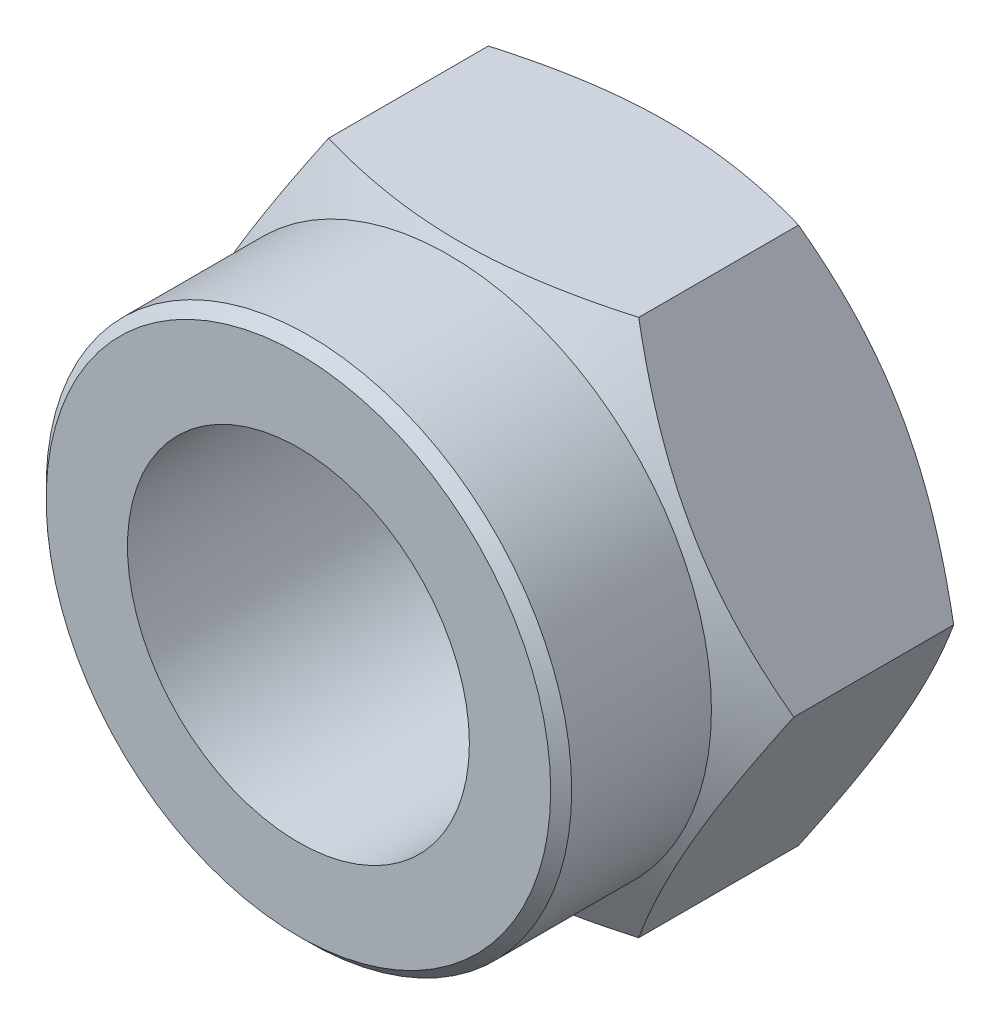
from build123d import *

# Parameters (mm, degrees)
SKETCH1_R      = 17.5
BASENUT_DEPTH  = 23.52
EXTRUDE1_START = 15.38
SKETCH2_R      = 26.9
SKETCH2_R_2    = 17.5
EXTRUDE1_DEPTH = 15.38
CHAMFER1_SIZE  = 1.076


with BuildPart() as part:
    # Sketch1 → BaseNut (new body)
    with BuildSketch(Plane.XY):
        Polygon((15.877132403, -27.5), (31.754264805, 0), (15.877132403, 27.5), (-15.877132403, 27.5), (-31.754264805, 0), (-15.877132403, -27.5), align=None)
        Circle(SKETCH1_R, mode=Mode.SUBTRACT)
    extrude(amount=-BASENUT_DEPTH)

    # Sketch3 → Double-Chamfer (revolve, cut)
    with BuildSketch(Plane(origin=(0, 0, 0), x_dir=(1, 0, 0), z_dir=(0, 1, 0)), mode=Mode.PRIVATE) as double_chamfer_sk:
        Polygon((25.555, 23.52), (31.754264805, 23.52), (31.754264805, 19.940852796), align=None)
        Polygon((31.754264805, 3.579147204), (25.555, 0), (31.754264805, 0), align=None)
    revolve(double_chamfer_sk.sketch.rotate(Axis((0, 0, -16.31077227), (0, 0, 1)), 180.000000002), axis=Axis((0, 0, -16.31077227), (0, 0, 1)), mode=Mode.SUBTRACT)

    # Sketch2 → Extrude1 (add)
    with BuildSketch(Plane(origin=(20.087129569, -4.281493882, 0), x_dir=(1, 0, 0), z_dir=(0, 0, 1)).offset(EXTRUDE1_START)):
        with Locations((-20.087129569, 4.281493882)):
            Circle(SKETCH2_R)
        with Locations((-20.087129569, 4.281493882)):
            Circle(SKETCH2_R_2, mode=Mode.SUBTRACT)
    extrude(amount=-EXTRUDE1_DEPTH)

    # Sketch5 → EndChamfer (revolve, cut)
    with BuildSketch(Plane(origin=(0, 0, 0), x_dir=(1, 0, 0), z_dir=(0, 1, 0))):
        Polygon((17.5, 23.52), (19.45, 23.52), (17.5, 21.57), align=None)
    revolve(axis=Axis((0, 0, -16.800797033), (0, 0, 1)), mode=Mode.SUBTRACT)

    # Chamfer1
    chamfer1_edges = [part.edges().sort_by_distance(p)[0] for p in [
        (-26.9, 0, 15.38),
    ]]
    chamfer(chamfer1_edges, length=CHAMFER1_SIZE)


solid = part.part
